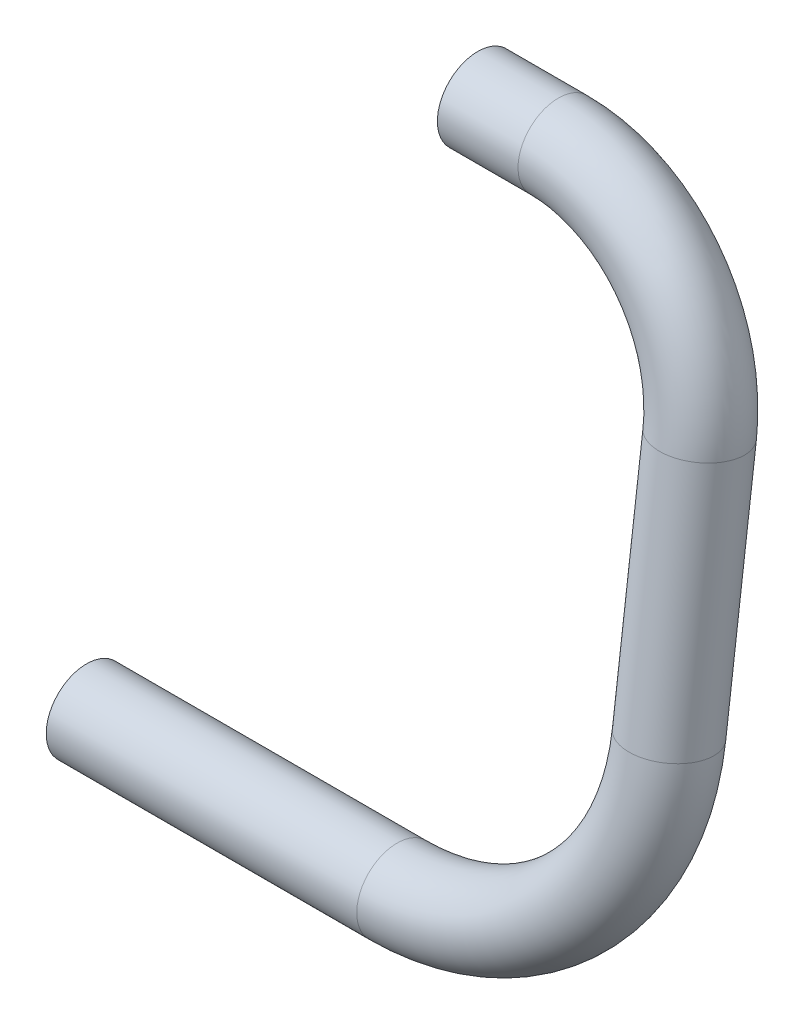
ISO-10303-21;
HEADER;
FILE_DESCRIPTION(('STEP AP214'),'2;1');
FILE_NAME('part.step','',(''),(''),'','','');
FILE_SCHEMA(('AUTOMOTIVE_DESIGN { 1 0 10303 214 1 1 1 1 }'));
ENDSEC;
DATA;
#1=APPLICATION_CONTEXT('core data for automotive mechanical design processes');
#2=APPLICATION_PROTOCOL_DEFINITION('international standard','automotive_design',2000,#1);
#3=PRODUCT_CONTEXT('',#1,'mechanical');
#4=PRODUCT('Part','Part','',(#3));
#5=PRODUCT_RELATED_PRODUCT_CATEGORY('part','',(#4));
#6=PRODUCT_DEFINITION_FORMATION('','',#4);
#7=PRODUCT_DEFINITION_CONTEXT('part definition',#1,'design');
#8=PRODUCT_DEFINITION('design','',#6,#7);
#9=PRODUCT_DEFINITION_SHAPE('','',#8);
#10=(LENGTH_UNIT() NAMED_UNIT(*) SI_UNIT(.MILLI.,.METRE.));
#11=(NAMED_UNIT(*) PLANE_ANGLE_UNIT() SI_UNIT($,.RADIAN.));
#12=(NAMED_UNIT(*) SI_UNIT($,.STERADIAN.) SOLID_ANGLE_UNIT());
#13=UNCERTAINTY_MEASURE_WITH_UNIT(LENGTH_MEASURE(1.E-05),#10,'distance_accuracy_value','');
#14=(GEOMETRIC_REPRESENTATION_CONTEXT(3) GLOBAL_UNCERTAINTY_ASSIGNED_CONTEXT((#13)) GLOBAL_UNIT_ASSIGNED_CONTEXT((#10,
#11,#12)) REPRESENTATION_CONTEXT('',''));
#15=CARTESIAN_POINT('',(0.,0.,0.));
#16=DIRECTION('',(0.,0.,1.));
#17=DIRECTION('',(1.,0.,0.));
#18=AXIS2_PLACEMENT_3D('',#15,#16,#17);
#19=CARTESIAN_POINT('',(30.7975,50.8,-6.34999999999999));
#20=DIRECTION('',(-1.,0.,0.));
#21=DIRECTION('',(0.,0.,1.));
#22=AXIS2_PLACEMENT_3D('',#19,#20,#21);
#23=CYLINDRICAL_SURFACE('',#22,3.175);
#24=CARTESIAN_POINT('',(30.7975,50.8,-6.34999999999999));
#25=DIRECTION('',(-1.,0.,0.));
#26=DIRECTION('',(0.,-0.246153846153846,-0.96923076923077));
#27=AXIS2_PLACEMENT_3D('',#24,#25,#26);
#28=CIRCLE('',#27,3.175);
#29=CARTESIAN_POINT('',(30.7975,53.9504822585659,-6.74381028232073));
#30=VERTEX_POINT('',#29);
#31=EDGE_CURVE('E30',#30,#30,#28,.T.);
#32=ORIENTED_EDGE('',*,*,#31,.T.);
#33=EDGE_LOOP('',(#32));
#34=FACE_BOUND('',#33,.T.);
#35=CARTESIAN_POINT('',(24.4475,50.8,-6.34999999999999));
#36=DIRECTION('',(-1.,0.,0.));
#37=DIRECTION('',(0.,-0.246153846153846,-0.96923076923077));
#38=AXIS2_PLACEMENT_3D('',#35,#36,#37);
#39=CIRCLE('',#38,3.175);
#40=CARTESIAN_POINT('',(24.4475,50.0184615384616,-9.42730769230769));
#41=VERTEX_POINT('',#40);
#42=EDGE_CURVE('E10',#41,#41,#39,.T.);
#43=ORIENTED_EDGE('',*,*,#42,.F.);
#44=EDGE_LOOP('',(#43));
#45=FACE_BOUND('',#44,.T.);
#46=ADVANCED_FACE('F24',(#34,#45),#23,.T.);
#47=CARTESIAN_POINT('',(30.7975,38.1980709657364,-4.77475887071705));
#48=DIRECTION('',(0.,0.124034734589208,0.992277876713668));
#49=DIRECTION('',(0.,-0.992277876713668,0.124034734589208));
#50=AXIS2_PLACEMENT_3D('',#47,#48,#49);
#51=TOROIDAL_SURFACE('',#50,12.7,3.175);
#52=CARTESIAN_POINT('',(43.4975,38.1980709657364,-4.77475887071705));
#53=DIRECTION('',(0.,0.992277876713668,-0.124034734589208));
#54=DIRECTION('',(-0.124034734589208,-0.123076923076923,-0.984615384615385));
#55=AXIS2_PLACEMENT_3D('',#52,#53,#54);
#56=CIRCLE('',#55,3.175);
#57=CARTESIAN_POINT('',(46.6725,38.1980709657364,-4.77475887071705));
#58=VERTEX_POINT('',#57);
#59=EDGE_CURVE('E34',#58,#58,#56,.T.);
#60=CARTESIAN_POINT('',(30.7975,38.1980709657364,-4.77475887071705));
#61=DIRECTION('',(0.,0.124034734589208,0.992277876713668));
#62=DIRECTION('',(0.,-0.992277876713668,0.124034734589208));
#63=AXIS2_PLACEMENT_3D('',#60,#61,#62);
#64=CIRCLE('',#63,15.875);
#65=EDGE_CURVE('',#58,#30,#64,.T.);
#66=ORIENTED_EDGE('',*,*,#59,.T.);
#67=ORIENTED_EDGE('',*,*,#31,.F.);
#68=ORIENTED_EDGE('',*,*,#65,.T.);
#69=ORIENTED_EDGE('',*,*,#65,.F.);
#70=EDGE_LOOP('',(#66,#68,#67,#69));
#71=FACE_BOUND('',#70,.T.);
#72=ADVANCED_FACE('F61',(#71),#51,.T.);
#73=CARTESIAN_POINT('',(43.4975,18.9028935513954,-2.36286169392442));
#74=DIRECTION('',(0.,0.992277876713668,-0.124034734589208));
#75=DIRECTION('',(0.,0.124034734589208,0.992277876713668));
#76=AXIS2_PLACEMENT_3D('',#73,#74,#75);
#77=CYLINDRICAL_SURFACE('',#76,3.175);
#78=CARTESIAN_POINT('',(43.4975,18.9028935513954,-2.36286169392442));
#79=DIRECTION('',(0.,0.992277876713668,-0.124034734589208));
#80=DIRECTION('',(-0.124034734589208,-0.123076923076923,-0.984615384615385));
#81=AXIS2_PLACEMENT_3D('',#78,#79,#80);
#82=CIRCLE('',#81,3.175);
#83=CARTESIAN_POINT('',(46.6725,18.9028935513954,-2.36286169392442));
#84=VERTEX_POINT('',#83);
#85=EDGE_CURVE('E38',#84,#84,#82,.T.);
#86=ORIENTED_EDGE('',*,*,#85,.T.);
#87=EDGE_LOOP('',(#86));
#88=FACE_BOUND('',#87,.T.);
#89=ORIENTED_EDGE('',*,*,#59,.F.);
#90=EDGE_LOOP('',(#89));
#91=FACE_BOUND('',#90,.T.);
#92=ADVANCED_FACE('F65',(#88,#91),#77,.T.);
#93=CARTESIAN_POINT('',(24.4475,18.9028935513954,-2.36286169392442));
#94=DIRECTION('',(0.,0.124034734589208,0.992277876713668));
#95=DIRECTION('',(0.,-0.992277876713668,0.124034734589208));
#96=AXIS2_PLACEMENT_3D('',#93,#94,#95);
#97=TOROIDAL_SURFACE('',#96,19.05,3.175);
#98=CARTESIAN_POINT('',(24.4475,0.,0.));
#99=DIRECTION('',(1.,0.,0.));
#100=DIRECTION('',(0.,0.,-1.));
#101=AXIS2_PLACEMENT_3D('',#98,#99,#100);
#102=CIRCLE('',#101,3.175);
#103=CARTESIAN_POINT('',(24.4475,-3.15048225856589,0.393810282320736));
#104=VERTEX_POINT('',#103);
#105=EDGE_CURVE('E43',#104,#104,#102,.T.);
#106=CARTESIAN_POINT('',(24.4475,18.9028935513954,-2.36286169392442));
#107=DIRECTION('',(0.,0.124034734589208,0.992277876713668));
#108=DIRECTION('',(0.,-0.992277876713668,0.124034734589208));
#109=AXIS2_PLACEMENT_3D('',#106,#107,#108);
#110=CIRCLE('',#109,22.225);
#111=EDGE_CURVE('',#104,#84,#110,.T.);
#112=ORIENTED_EDGE('',*,*,#105,.T.);
#113=ORIENTED_EDGE('',*,*,#85,.F.);
#114=ORIENTED_EDGE('',*,*,#111,.T.);
#115=ORIENTED_EDGE('',*,*,#111,.F.);
#116=EDGE_LOOP('',(#112,#114,#113,#115));
#117=FACE_BOUND('',#116,.T.);
#118=ADVANCED_FACE('F71',(#117),#97,.T.);
#119=CARTESIAN_POINT('',(24.4475,0.,0.));
#120=DIRECTION('',(-1.,0.,0.));
#121=DIRECTION('',(0.,0.,1.));
#122=AXIS2_PLACEMENT_3D('',#119,#120,#121);
#123=CYLINDRICAL_SURFACE('',#122,3.175);
#124=ORIENTED_EDGE('',*,*,#105,.F.);
#125=EDGE_LOOP('',(#124));
#126=FACE_BOUND('',#125,.T.);
#127=CARTESIAN_POINT('',(0.,0.,0.));
#128=DIRECTION('',(1.,0.,0.));
#129=DIRECTION('',(0.,0.,-1.));
#130=AXIS2_PLACEMENT_3D('',#127,#128,#129);
#131=CIRCLE('',#130,3.175);
#132=CARTESIAN_POINT('',(0.,0.,-3.175));
#133=VERTEX_POINT('',#132);
#134=EDGE_CURVE('E46',#133,#133,#131,.T.);
#135=ORIENTED_EDGE('',*,*,#134,.T.);
#136=EDGE_LOOP('',(#135));
#137=FACE_BOUND('',#136,.T.);
#138=ADVANCED_FACE('F50',(#126,#137),#123,.T.);
#139=CARTESIAN_POINT('',(24.4475,50.8,-6.35));
#140=DIRECTION('',(-1.,0.,0.));
#141=DIRECTION('',(0.,-0.246153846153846,-0.96923076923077));
#142=AXIS2_PLACEMENT_3D('',#139,#140,#141);
#143=PLANE('',#142);
#144=ORIENTED_EDGE('',*,*,#42,.T.);
#145=EDGE_LOOP('',(#144));
#146=FACE_BOUND('',#145,.T.);
#147=ADVANCED_FACE('F54',(#146),#143,.T.);
#148=CARTESIAN_POINT('',(0.,0.,0.));
#149=DIRECTION('',(1.,0.,0.));
#150=DIRECTION('',(0.,0.,-1.));
#151=AXIS2_PLACEMENT_3D('',#148,#149,#150);
#152=PLANE('',#151);
#153=ORIENTED_EDGE('',*,*,#134,.F.);
#154=EDGE_LOOP('',(#153));
#155=FACE_BOUND('',#154,.T.);
#156=ADVANCED_FACE('F52',(#155),#152,.F.);
#157=CLOSED_SHELL('',(#46,#72,#92,#118,#138,#147,#156));
#158=MANIFOLD_SOLID_BREP('B2',#157);
#159=ADVANCED_BREP_SHAPE_REPRESENTATION('',(#18,#158),#14);
#160=SHAPE_DEFINITION_REPRESENTATION(#9,#159);
ENDSEC;
END-ISO-10303-21;
